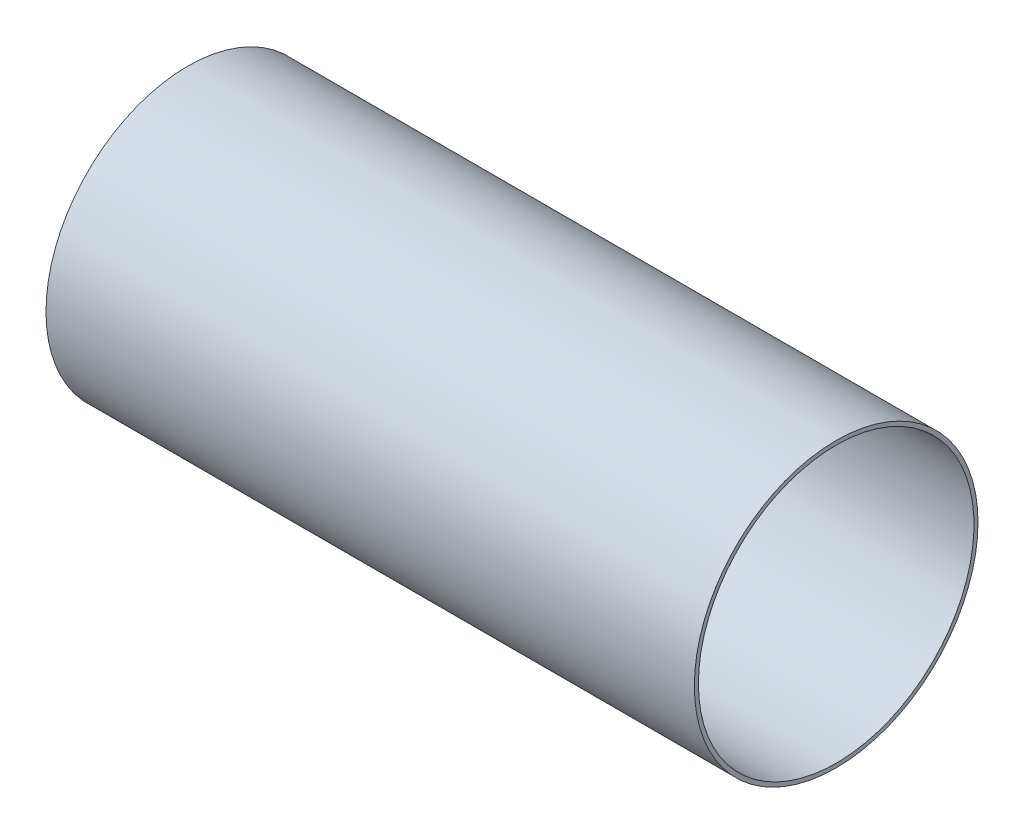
from build123d import *


with BuildPart() as part:
    # Esquisse1 → R_vol.-Mince1 (revolve)
    with BuildSketch(Plane.XY, mode=Mode.PRIVATE) as r_vol_mince1_sk:
        Polygon((0.8, 0.8), (0, 0.8), (0, 3.5), (16, 3.5), (16, 3.4), (0.1, 3.4), (0.1, 0.9), (0.8, 0.9), align=None)
    revolve(r_vol_mince1_sk.sketch.rotate(Axis((0, 0, 0), (1, 0, 0)), 90), axis=Axis((0, 0, 0), (1, 0, 0)))


solid = part.part
